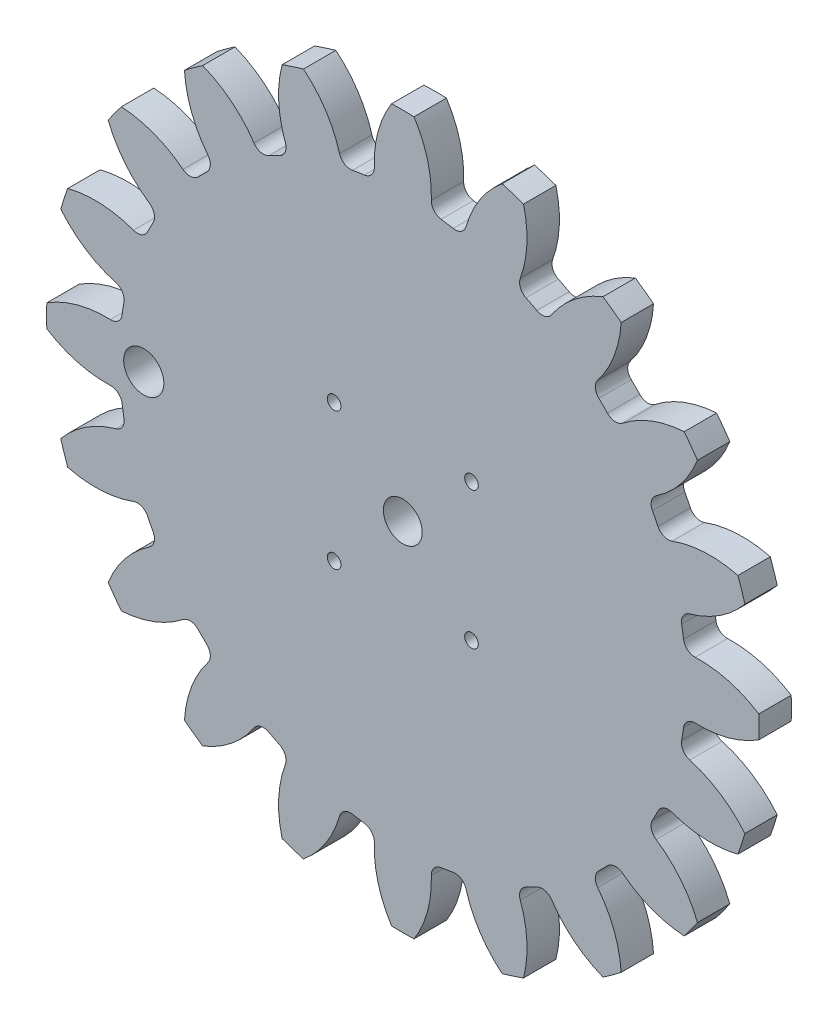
from build123d import *

# Parameters (mm, degrees)
BOSS_EXTRU_1_DEPTH                 = 5
CONG_1_R                           = 1.75
R_P_TITION_CIRCULAIRE4_COUNT       = 20
CONG_1_OF_R_P_TITION_CIRCULAIRE4_R = 1.75
ESQUISSE6_R                        = 3
ENL_V_MAT_EXTRU_1_DEPTH            = 10
ESQUISSE8_R                        = 1.05
ESQUISSE8_R_2                      = 3.1
ENL_V_MAT_EXTRU_3_DEPTH            = 78.942286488


with BuildPart() as part:
    # Esquisse3 → Boss.-Extru.1 (new body)
    with BuildSketch(Plane.XY):
        with BuildLine():
            Line((-6.844007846, 43.211364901), (0, 0))
            Line((0, 0), (6.844007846, 43.211364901))
            ThreePointArc((6.844007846, 43.211364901), (5.558296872, 43.395481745), (4.267687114, 43.541352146))
            ThreePointArc((4.267687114, 43.541352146), (4.008250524, 49.47966893), (1.736911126, 54.972567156))
            ThreePointArc((1.736911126, 54.972567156), (0, 55), (-1.736911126, 54.972567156))
            ThreePointArc((-1.736911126, 54.972567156), (-4.008250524, 49.47966893), (-4.267687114, 43.541352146))
            ThreePointArc((-4.267687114, 43.541352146), (-5.558296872, 43.395481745), (-6.844007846, 43.211364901))
        make_face()
    boss_extru_1 = extrude(amount=BOSS_EXTRU_1_DEPTH)

    # Cong_1
    cong_1_edges = [part.edges().sort_by_distance(p)[0] for p in [
        (-4.267687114, 43.541352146, 2.5),
        (4.267687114, 43.541352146, 2.5),
    ]]
    fillet(cong_1_edges, radius=CONG_1_R)

    # R_p_tition circulaire4: Boss.-Extru.1 ×20 about axis
    r_p_tition_circulaire4_axis = Axis((0, 0, 0), (0, 0, 1))
    for i in range(1, R_P_TITION_CIRCULAIRE4_COUNT):
        add(boss_extru_1.rotate(r_p_tition_circulaire4_axis, i * 360 / R_P_TITION_CIRCULAIRE4_COUNT))

    # Cong_1 of R_p_tition circulaire4
    cong_1_of_r_p_tition_circulaire4_edges = [part.edges().sort_by_distance(p)[0] for p in [
        (-17.513829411, 40.091498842, 2.5),
        (-9.396206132, 42.729074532, 2.5),
        (-29.045596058, 32.717210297, 2.5),
        (-22.140333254, 37.734177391, 2.5),
        (-37.734177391, 22.140333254, 2.5),
        (-32.717210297, 29.045596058, 2.5),
        (-42.729074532, 9.396206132, 2.5),
        (-40.091498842, 17.513829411, 2.5),
        (-43.541352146, -4.267687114, 2.5),
        (-43.541352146, 4.267687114, 2.5),
        (-40.091498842, -17.513829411, 2.5),
        (-42.729074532, -9.396206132, 2.5),
        (-32.717210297, -29.045596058, 2.5),
        (-37.734177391, -22.140333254, 2.5),
        (-22.140333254, -37.734177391, 2.5),
        (-29.045596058, -32.717210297, 2.5),
        (-9.396206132, -42.729074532, 2.5),
        (-17.513829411, -40.091498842, 2.5),
        (4.267687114, -43.541352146, 2.5),
        (-4.267687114, -43.541352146, 2.5),
        (17.513829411, -40.091498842, 2.5),
        (9.396206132, -42.729074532, 2.5),
        (29.045596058, -32.717210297, 2.5),
        (22.140333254, -37.734177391, 2.5),
        (37.734177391, -22.140333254, 2.5),
        (32.717210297, -29.045596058, 2.5),
        (42.729074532, -9.396206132, 2.5),
        (40.091498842, -17.513829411, 2.5),
        (43.541352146, 4.267687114, 2.5),
        (43.541352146, -4.267687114, 2.5),
        (40.091498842, 17.513829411, 2.5),
        (42.729074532, 9.396206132, 2.5),
        (32.717210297, 29.045596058, 2.5),
        (37.734177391, 22.140333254, 2.5),
        (22.140333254, 37.734177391, 2.5),
        (29.045596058, 32.717210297, 2.5),
        (9.396206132, 42.729074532, 2.5),
        (17.513829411, 40.091498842, 2.5),
    ]]
    fillet(cong_1_of_r_p_tition_circulaire4_edges, radius=CONG_1_OF_R_P_TITION_CIRCULAIRE4_R)

    # Esquisse6 → Enl_v. mat.-Extru.1 (cut)
    with BuildSketch(Plane.XY.offset(5)):
        Circle(ESQUISSE6_R)
    extrude(amount=-ENL_V_MAT_EXTRU_1_DEPTH, mode=Mode.SUBTRACT)

    # Esquisse8 → Enl_v. mat.-Extru.3 (cut, through all)
    with BuildSketch(Plane.XY.offset(5)):
        with Locations((-10.606601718, 10.606601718)):
            Circle(ESQUISSE8_R)
        with Locations((10.606601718, -10.606601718)):
            Circle(ESQUISSE8_R)
        with Locations((-10.606601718, -10.606601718)):
            Circle(ESQUISSE8_R)
        with Locations(Location((10.606601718, 10.606601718, 0), (0, 0, 180))):
            Circle(ESQUISSE8_R)
        with Locations((-40, 0)):
            Circle(ESQUISSE8_R_2)
    extrude(amount=-ENL_V_MAT_EXTRU_3_DEPTH, mode=Mode.SUBTRACT)


solid = part.part
